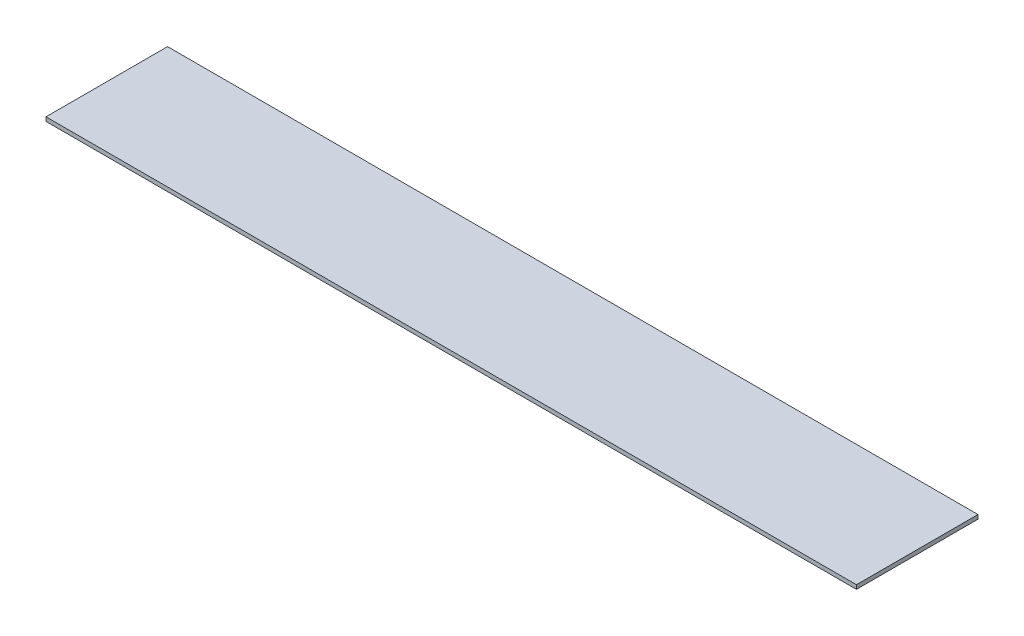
from build123d import *

# Parameters (mm, degrees)
ESQUISSE1_W      = 400
ESQUISSE1_H      = 60
EXTRUSION1_DEPTH = 2


with BuildPart() as part:
    # Esquisse1 → Extrusion1 (new body)
    with BuildSketch(Plane(origin=(0, 0, 0), x_dir=(1, 0, 0), z_dir=(0, 1, 0))):
        with Locations((200, 30)):
            Rectangle(ESQUISSE1_W, ESQUISSE1_H)
    extrude(amount=EXTRUSION1_DEPTH)


solid = part.part
